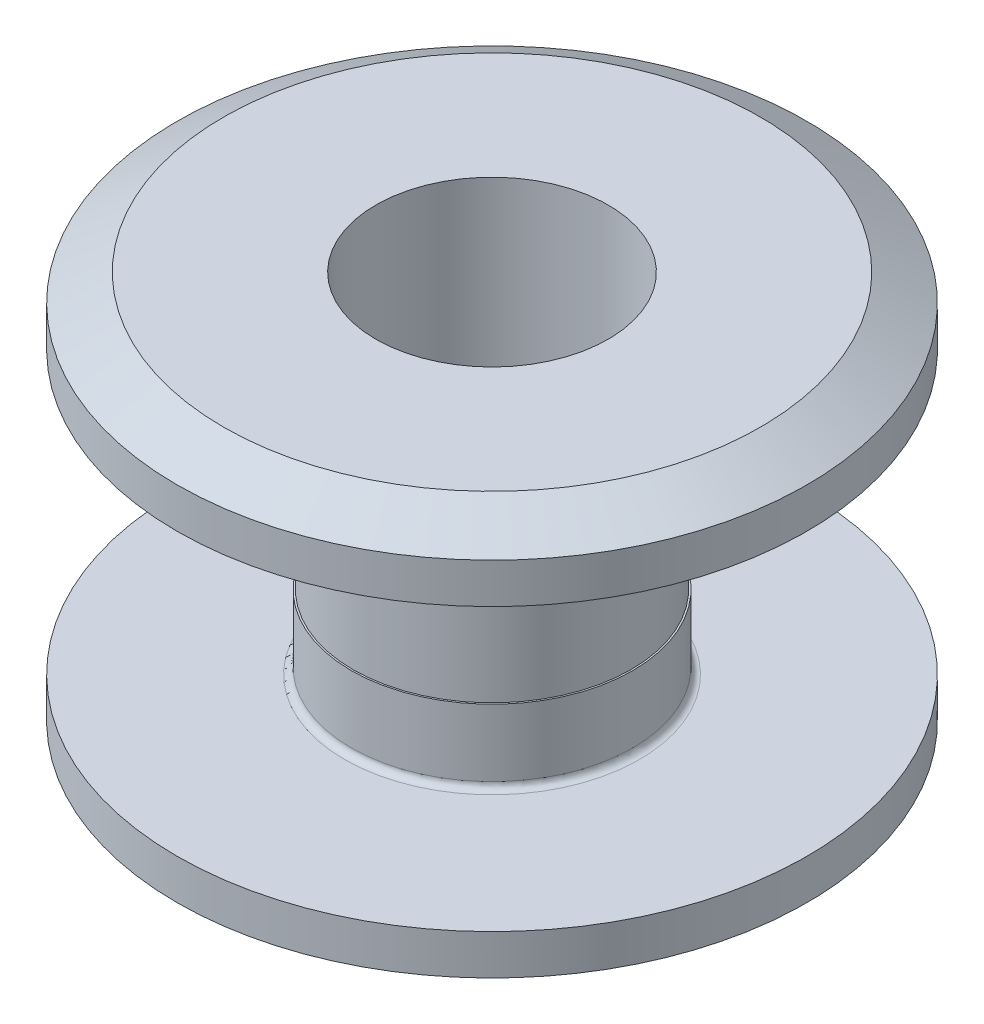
from build123d import *
from OCP.BRepFilletAPI import BRepFilletAPI_MakeChamfer

# Parameters (mm, degrees)
CHANFREIN1_SIZE         = 4
CHANFREIN1_SIZE2        = 6.92820323
CONG_2_R                = 1
ESQUISSE2_R             = 17.35
ENL_V_MAT_EXTRU_2_DEPTH = 91.895544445


with BuildPart() as part:
    # Esquisse1 → R_volution1 (revolve)
    with BuildSketch(Plane.XY, mode=Mode.PRIVATE) as r_volution1_sk:
        Polygon((0, 0), (-47, 0), (-47, 10), (-21, 10), (-21, 21), (-20.75, 21), (-20.75, 41), (-21, 41), (-21, 52), (-47, 52), (-47, 62), (0, 62), align=None)
    revolve(r_volution1_sk.sketch.rotate(Axis((0, 99.333427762, 0), (0, -1, 0)), 270), axis=Axis((0, 99.333427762, 0), (0, -1, 0)))

    # Chanfrein1: one chamfer whose edges measure the first distance from different faces: ONE call of the kernel's chamfer builder (chamfer() names one face for all edges)
    chanfrein1_edges_1 = [part.edges().sort_by_distance(p)[0] for p in [
        (0, 62, -47),
    ]]
    chanfrein1_side_1 = [part.faces().sort_by_distance(p)[0] for p in [
        (0, 57, -47),
    ]]
    chanfrein1_edges_2 = [part.edges().sort_by_distance(p)[0] for p in [
        (0, 0, -47),
    ]]
    chanfrein1_side_2 = [part.faces().sort_by_distance(p)[0] for p in [
        (0, 5, -47),
    ]]
    chanfrein1 = BRepFilletAPI_MakeChamfer(part.part.solid().wrapped)
    for e in chanfrein1_edges_1:
        chanfrein1.Add(CHANFREIN1_SIZE, CHANFREIN1_SIZE2, e.wrapped, chanfrein1_side_1[0].wrapped)  # the first distance lies on this face
    for e in chanfrein1_edges_2:
        chanfrein1.Add(CHANFREIN1_SIZE, CHANFREIN1_SIZE2, e.wrapped, chanfrein1_side_2[0].wrapped)  # the first distance lies on this face
    add(Compound.cast(chanfrein1.Shape()), mode=Mode.REPLACE)

    # Cong_2
    cong_2_edges = [part.edges().sort_by_distance(p)[0] for p in [
        (0, 52, -21),
        (0, 10, -21),
    ]]
    fillet(cong_2_edges, radius=CONG_2_R)

    # Esquisse2 → Enl_v. mat.-Extru.2 (cut, through all)
    with BuildSketch(Plane(origin=(0, 0, 0), x_dir=(1, 0, 0), z_dir=(0, 1, 0))):
        with Locations(Location((0, 0, 0), (0, 0, 270))):
            Circle(ESQUISSE2_R)
    extrude(amount=ENL_V_MAT_EXTRU_2_DEPTH, mode=Mode.SUBTRACT)


solid = part.part
